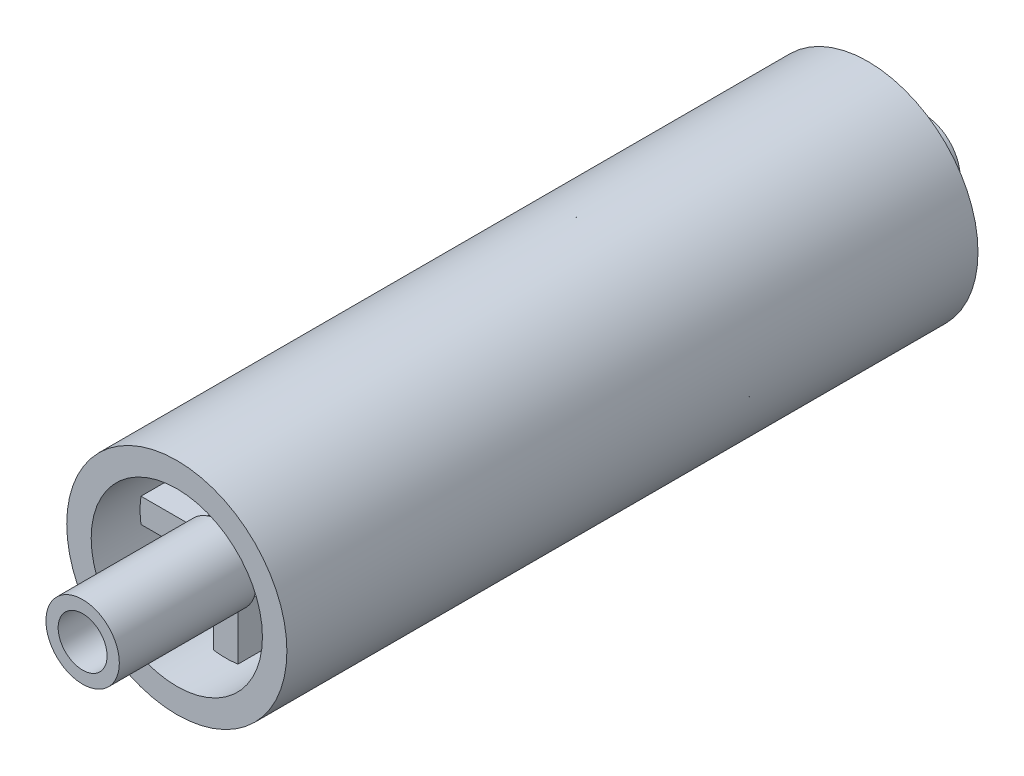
ISO-10303-21;
HEADER;
FILE_DESCRIPTION(('STEP AP214'),'2;1');
FILE_NAME('part.step','',(''),(''),'','','');
FILE_SCHEMA(('AUTOMOTIVE_DESIGN { 1 0 10303 214 1 1 1 1 }'));
ENDSEC;
DATA;
#1=APPLICATION_CONTEXT('core data for automotive mechanical design processes');
#2=APPLICATION_PROTOCOL_DEFINITION('international standard','automotive_design',2000,#1);
#3=PRODUCT_CONTEXT('',#1,'mechanical');
#4=PRODUCT('Part','Part','',(#3));
#5=PRODUCT_RELATED_PRODUCT_CATEGORY('part','',(#4));
#6=PRODUCT_DEFINITION_FORMATION('','',#4);
#7=PRODUCT_DEFINITION_CONTEXT('part definition',#1,'design');
#8=PRODUCT_DEFINITION('design','',#6,#7);
#9=PRODUCT_DEFINITION_SHAPE('','',#8);
#10=(LENGTH_UNIT() NAMED_UNIT(*) SI_UNIT(.MILLI.,.METRE.));
#11=(NAMED_UNIT(*) PLANE_ANGLE_UNIT() SI_UNIT($,.RADIAN.));
#12=(NAMED_UNIT(*) SI_UNIT($,.STERADIAN.) SOLID_ANGLE_UNIT());
#13=UNCERTAINTY_MEASURE_WITH_UNIT(LENGTH_MEASURE(1.E-05),#10,'distance_accuracy_value','');
#14=(GEOMETRIC_REPRESENTATION_CONTEXT(3) GLOBAL_UNCERTAINTY_ASSIGNED_CONTEXT((#13)) GLOBAL_UNIT_ASSIGNED_CONTEXT((#10,
#11,#12)) REPRESENTATION_CONTEXT('',''));
#15=CARTESIAN_POINT('',(0.,0.,0.));
#16=DIRECTION('',(0.,0.,1.));
#17=DIRECTION('',(1.,0.,0.));
#18=AXIS2_PLACEMENT_3D('',#15,#16,#17);
#19=CARTESIAN_POINT('',(0.,0.,-25.7));
#20=DIRECTION('',(0.,0.,-1.));
#21=DIRECTION('',(-1.,0.,0.));
#22=AXIS2_PLACEMENT_3D('',#19,#20,#21);
#23=CYLINDRICAL_SURFACE('',#22,3.);
#24=CARTESIAN_POINT('',(0.,0.,-25.7));
#25=DIRECTION('',(0.,0.,-1.));
#26=DIRECTION('',(-1.,0.,0.));
#27=AXIS2_PLACEMENT_3D('',#24,#25,#26);
#28=CIRCLE('',#27,3.);
#29=CARTESIAN_POINT('',(-3.,0.,-25.7));
#30=VERTEX_POINT('',#29);
#31=EDGE_CURVE('E51',#30,#30,#28,.T.);
#32=ORIENTED_EDGE('',*,*,#31,.T.);
#33=EDGE_LOOP('',(#32));
#34=FACE_BOUND('',#33,.T.);
#35=CARTESIAN_POINT('',(0.,0.,-32.8));
#36=DIRECTION('',(0.,0.,-1.));
#37=DIRECTION('',(-1.,0.,0.));
#38=AXIS2_PLACEMENT_3D('',#35,#36,#37);
#39=CIRCLE('',#38,3.);
#40=CARTESIAN_POINT('',(-3.,0.,-32.8));
#41=VERTEX_POINT('',#40);
#42=EDGE_CURVE('E120',#41,#41,#39,.T.);
#43=ORIENTED_EDGE('',*,*,#42,.F.);
#44=EDGE_LOOP('',(#43));
#45=FACE_BOUND('',#44,.T.);
#46=ADVANCED_FACE('F44',(#34,#45),#23,.T.);
#47=CARTESIAN_POINT('',(0.,0.,-25.7));
#48=DIRECTION('',(0.,0.,-1.));
#49=DIRECTION('',(-1.,0.,0.));
#50=AXIS2_PLACEMENT_3D('',#47,#48,#49);
#51=CYLINDRICAL_SURFACE('',#50,2.);
#52=CARTESIAN_POINT('',(0.,0.,-32.8));
#53=DIRECTION('',(0.,0.,-1.));
#54=DIRECTION('',(-1.,0.,0.));
#55=AXIS2_PLACEMENT_3D('',#52,#53,#54);
#56=CIRCLE('',#55,2.);
#57=CARTESIAN_POINT('',(1.3228756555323,-1.5,-32.8));
#58=VERTEX_POINT('',#57);
#59=CARTESIAN_POINT('',(1.3228756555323,1.5,-32.8));
#60=VERTEX_POINT('',#59);
#61=EDGE_CURVE('E83',#58,#60,#56,.F.);
#62=ORIENTED_EDGE('',*,*,#61,.F.);
#63=DIRECTION('',(0.,0.,-1.));
#64=VECTOR('',#63,1.);
#65=CARTESIAN_POINT('',(1.3228756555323,-1.5,-25.7));
#66=LINE('',#65,#64);
#67=CARTESIAN_POINT('',(1.3228756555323,-1.5,-25.7));
#68=VERTEX_POINT('',#67);
#69=EDGE_CURVE('E91',#68,#58,#66,.T.);
#70=ORIENTED_EDGE('',*,*,#69,.F.);
#71=CARTESIAN_POINT('',(0.,0.,-25.7));
#72=DIRECTION('',(0.,0.,-1.));
#73=DIRECTION('',(-1.,0.,0.));
#74=AXIS2_PLACEMENT_3D('',#71,#72,#73);
#75=CIRCLE('',#74,2.);
#76=CARTESIAN_POINT('',(1.3228756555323,1.5,-25.7));
#77=VERTEX_POINT('',#76);
#78=EDGE_CURVE('E94',#77,#68,#75,.T.);
#79=ORIENTED_EDGE('',*,*,#78,.F.);
#80=DIRECTION('',(0.,0.,-1.));
#81=VECTOR('',#80,1.);
#82=CARTESIAN_POINT('',(1.3228756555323,1.5,-25.7));
#83=LINE('',#82,#81);
#84=EDGE_CURVE('E93',#77,#60,#83,.T.);
#85=ORIENTED_EDGE('',*,*,#84,.T.);
#86=EDGE_LOOP('',(#62,#70,#79,#85));
#87=FACE_BOUND('',#86,.T.);
#88=ADVANCED_FACE('F89',(#87),#51,.F.);
#89=CARTESIAN_POINT('',(1.3228756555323,1.5,-25.7));
#90=DIRECTION('',(0.,1.,0.));
#91=DIRECTION('',(0.,0.,1.));
#92=AXIS2_PLACEMENT_3D('',#89,#90,#91);
#93=PLANE('',#92);
#94=DIRECTION('',(-1.,0.,0.));
#95=VECTOR('',#94,1.);
#96=CARTESIAN_POINT('',(1.3228756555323,1.5,-32.8));
#97=LINE('',#96,#95);
#98=CARTESIAN_POINT('',(-1.32287565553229,1.5,-32.8));
#99=VERTEX_POINT('',#98);
#100=EDGE_CURVE('E95',#60,#99,#97,.T.);
#101=ORIENTED_EDGE('',*,*,#100,.F.);
#102=ORIENTED_EDGE('',*,*,#84,.F.);
#103=DIRECTION('',(1.,0.,0.));
#104=VECTOR('',#103,1.);
#105=CARTESIAN_POINT('',(1.3228756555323,1.5,-25.7));
#106=LINE('',#105,#104);
#107=CARTESIAN_POINT('',(-1.32287565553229,1.5,-25.7));
#108=VERTEX_POINT('',#107);
#109=EDGE_CURVE('E102',#108,#77,#106,.T.);
#110=ORIENTED_EDGE('',*,*,#109,.F.);
#111=DIRECTION('',(0.,0.,-1.));
#112=VECTOR('',#111,1.);
#113=CARTESIAN_POINT('',(-1.32287565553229,1.5,-25.7));
#114=LINE('',#113,#112);
#115=EDGE_CURVE('E104',#108,#99,#114,.T.);
#116=ORIENTED_EDGE('',*,*,#115,.T.);
#117=EDGE_LOOP('',(#101,#102,#110,#116));
#118=FACE_BOUND('',#117,.T.);
#119=ADVANCED_FACE('F129',(#118),#93,.F.);
#120=CARTESIAN_POINT('',(0.,0.,-25.7));
#121=DIRECTION('',(0.,0.,-1.));
#122=DIRECTION('',(-1.,0.,0.));
#123=AXIS2_PLACEMENT_3D('',#120,#121,#122);
#124=CYLINDRICAL_SURFACE('',#123,2.);
#125=CARTESIAN_POINT('',(0.,0.,-32.8));
#126=DIRECTION('',(0.,0.,-1.));
#127=DIRECTION('',(-1.,0.,0.));
#128=AXIS2_PLACEMENT_3D('',#125,#126,#127);
#129=CIRCLE('',#128,2.);
#130=CARTESIAN_POINT('',(-1.3228756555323,-1.5,-32.8));
#131=VERTEX_POINT('',#130);
#132=EDGE_CURVE('E57',#99,#131,#129,.F.);
#133=ORIENTED_EDGE('',*,*,#132,.F.);
#134=ORIENTED_EDGE('',*,*,#115,.F.);
#135=CARTESIAN_POINT('',(0.,0.,-25.7));
#136=DIRECTION('',(0.,0.,-1.));
#137=DIRECTION('',(-1.,0.,0.));
#138=AXIS2_PLACEMENT_3D('',#135,#136,#137);
#139=CIRCLE('',#138,2.);
#140=CARTESIAN_POINT('',(-1.3228756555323,-1.5,-25.7));
#141=VERTEX_POINT('',#140);
#142=EDGE_CURVE('E65',#141,#108,#139,.T.);
#143=ORIENTED_EDGE('',*,*,#142,.F.);
#144=DIRECTION('',(0.,0.,-1.));
#145=VECTOR('',#144,1.);
#146=CARTESIAN_POINT('',(-1.3228756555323,-1.5,-25.7));
#147=LINE('',#146,#145);
#148=EDGE_CURVE('E101',#141,#131,#147,.T.);
#149=ORIENTED_EDGE('',*,*,#148,.T.);
#150=EDGE_LOOP('',(#133,#134,#143,#149));
#151=FACE_BOUND('',#150,.T.);
#152=ADVANCED_FACE('F134',(#151),#124,.F.);
#153=CARTESIAN_POINT('',(1.3228756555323,-1.5,-25.7));
#154=DIRECTION('',(0.,-1.,0.));
#155=DIRECTION('',(0.,0.,-1.));
#156=AXIS2_PLACEMENT_3D('',#153,#154,#155);
#157=PLANE('',#156);
#158=DIRECTION('',(1.,0.,0.));
#159=VECTOR('',#158,1.);
#160=CARTESIAN_POINT('',(1.3228756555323,-1.5,-32.8));
#161=LINE('',#160,#159);
#162=EDGE_CURVE('E13',#131,#58,#161,.T.);
#163=ORIENTED_EDGE('',*,*,#162,.F.);
#164=ORIENTED_EDGE('',*,*,#148,.F.);
#165=DIRECTION('',(-1.,0.,0.));
#166=VECTOR('',#165,1.);
#167=CARTESIAN_POINT('',(1.3228756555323,-1.5,-25.7));
#168=LINE('',#167,#166);
#169=EDGE_CURVE('E99',#68,#141,#168,.T.);
#170=ORIENTED_EDGE('',*,*,#169,.F.);
#171=ORIENTED_EDGE('',*,*,#69,.T.);
#172=EDGE_LOOP('',(#163,#164,#170,#171));
#173=FACE_BOUND('',#172,.T.);
#174=ADVANCED_FACE('F97',(#173),#157,.F.);
#175=CARTESIAN_POINT('',(0.,0.,-25.7));
#176=DIRECTION('',(0.,0.,-1.));
#177=DIRECTION('',(-1.,0.,0.));
#178=AXIS2_PLACEMENT_3D('',#175,#176,#177);
#179=PLANE('',#178);
#180=ORIENTED_EDGE('',*,*,#109,.T.);
#181=ORIENTED_EDGE('',*,*,#78,.T.);
#182=ORIENTED_EDGE('',*,*,#169,.T.);
#183=ORIENTED_EDGE('',*,*,#142,.T.);
#184=EDGE_LOOP('',(#180,#181,#182,#183));
#185=FACE_BOUND('',#184,.T.);
#186=ORIENTED_EDGE('',*,*,#31,.F.);
#187=EDGE_LOOP('',(#186));
#188=FACE_BOUND('',#187,.T.);
#189=ADVANCED_FACE('F139',(#185,#188),#179,.F.);
#190=CARTESIAN_POINT('',(0.,0.,-32.8));
#191=DIRECTION('',(0.,0.,-1.));
#192=DIRECTION('',(-1.,0.,0.));
#193=AXIS2_PLACEMENT_3D('',#190,#191,#192);
#194=PLANE('',#193);
#195=ORIENTED_EDGE('',*,*,#42,.T.);
#196=EDGE_LOOP('',(#195));
#197=FACE_BOUND('',#196,.T.);
#198=ORIENTED_EDGE('',*,*,#61,.T.);
#199=ORIENTED_EDGE('',*,*,#100,.T.);
#200=ORIENTED_EDGE('',*,*,#132,.T.);
#201=ORIENTED_EDGE('',*,*,#162,.T.);
#202=EDGE_LOOP('',(#198,#199,#200,#201));
#203=FACE_BOUND('',#202,.T.);
#204=ADVANCED_FACE('F82',(#197,#203),#194,.T.);
#205=CLOSED_SHELL('',(#46,#88,#119,#152,#174,#189,#204));
#206=MANIFOLD_SOLID_BREP('B2',#205);
#207=CARTESIAN_POINT('',(0.,0.,24.75));
#208=DIRECTION('',(0.,0.,1.));
#209=DIRECTION('',(1.,0.,0.));
#210=AXIS2_PLACEMENT_3D('',#207,#208,#209);
#211=CYLINDRICAL_SURFACE('',#210,3.);
#212=CARTESIAN_POINT('',(0.,0.,24.75));
#213=DIRECTION('',(0.,0.,1.));
#214=DIRECTION('',(1.,0.,0.));
#215=AXIS2_PLACEMENT_3D('',#212,#213,#214);
#216=CIRCLE('',#215,3.);
#217=CARTESIAN_POINT('',(3.,0.,24.75));
#218=VERTEX_POINT('',#217);
#219=EDGE_CURVE('E43',#218,#218,#216,.T.);
#220=ORIENTED_EDGE('',*,*,#219,.T.);
#221=EDGE_LOOP('',(#220));
#222=FACE_BOUND('',#221,.T.);
#223=CARTESIAN_POINT('',(0.,0.,35.95));
#224=DIRECTION('',(0.,0.,1.));
#225=DIRECTION('',(1.,0.,0.));
#226=AXIS2_PLACEMENT_3D('',#223,#224,#225);
#227=CIRCLE('',#226,3.);
#228=CARTESIAN_POINT('',(3.,0.,35.95));
#229=VERTEX_POINT('',#228);
#230=EDGE_CURVE('E208',#229,#229,#227,.T.);
#231=ORIENTED_EDGE('',*,*,#230,.F.);
#232=EDGE_LOOP('',(#231));
#233=FACE_BOUND('',#232,.T.);
#234=ADVANCED_FACE('F198',(#222,#233),#211,.T.);
#235=CARTESIAN_POINT('',(0.,0.,24.75));
#236=DIRECTION('',(0.,0.,1.));
#237=DIRECTION('',(1.,0.,0.));
#238=AXIS2_PLACEMENT_3D('',#235,#236,#237);
#239=PLANE('',#238);
#240=CARTESIAN_POINT('',(0.,0.,24.75));
#241=DIRECTION('',(0.,0.,1.));
#242=DIRECTION('',(1.,0.,0.));
#243=AXIS2_PLACEMENT_3D('',#240,#241,#242);
#244=CIRCLE('',#243,2.);
#245=CARTESIAN_POINT('',(2.,0.,24.75));
#246=VERTEX_POINT('',#245);
#247=EDGE_CURVE('E204',#246,#246,#244,.T.);
#248=ORIENTED_EDGE('',*,*,#247,.T.);
#249=EDGE_LOOP('',(#248));
#250=FACE_BOUND('',#249,.T.);
#251=ORIENTED_EDGE('',*,*,#219,.F.);
#252=EDGE_LOOP('',(#251));
#253=FACE_BOUND('',#252,.T.);
#254=ADVANCED_FACE('F227',(#250,#253),#239,.F.);
#255=CARTESIAN_POINT('',(0.,0.,24.75));
#256=DIRECTION('',(0.,0.,1.));
#257=DIRECTION('',(1.,0.,0.));
#258=AXIS2_PLACEMENT_3D('',#255,#256,#257);
#259=CYLINDRICAL_SURFACE('',#258,2.);
#260=ORIENTED_EDGE('',*,*,#247,.F.);
#261=EDGE_LOOP('',(#260));
#262=FACE_BOUND('',#261,.T.);
#263=CARTESIAN_POINT('',(0.,0.,35.95));
#264=DIRECTION('',(0.,0.,1.));
#265=DIRECTION('',(1.,0.,0.));
#266=AXIS2_PLACEMENT_3D('',#263,#264,#265);
#267=CIRCLE('',#266,2.);
#268=CARTESIAN_POINT('',(2.,0.,35.95));
#269=VERTEX_POINT('',#268);
#270=EDGE_CURVE('E212',#269,#269,#267,.T.);
#271=ORIENTED_EDGE('',*,*,#270,.T.);
#272=EDGE_LOOP('',(#271));
#273=FACE_BOUND('',#272,.T.);
#274=ADVANCED_FACE('F218',(#262,#273),#259,.F.);
#275=CARTESIAN_POINT('',(0.,0.,35.95));
#276=DIRECTION('',(0.,0.,1.));
#277=DIRECTION('',(1.,0.,0.));
#278=AXIS2_PLACEMENT_3D('',#275,#276,#277);
#279=PLANE('',#278);
#280=ORIENTED_EDGE('',*,*,#230,.T.);
#281=EDGE_LOOP('',(#280));
#282=FACE_BOUND('',#281,.T.);
#283=ORIENTED_EDGE('',*,*,#270,.F.);
#284=EDGE_LOOP('',(#283));
#285=FACE_BOUND('',#284,.T.);
#286=ADVANCED_FACE('F220',(#282,#285),#279,.T.);
#287=CLOSED_SHELL('',(#234,#254,#274,#286));
#288=MANIFOLD_SOLID_BREP('B7',#287);
#289=CARTESIAN_POINT('',(0.,0.,34.25));
#290=DIRECTION('',(0.,0.,-1.));
#291=DIRECTION('',(-1.,0.,0.));
#292=AXIS2_PLACEMENT_3D('',#289,#290,#291);
#293=CYLINDRICAL_SURFACE('',#292,9.);
#294=CARTESIAN_POINT('',(0.,0.,-28.25));
#295=DIRECTION('',(0.,0.,-1.));
#296=DIRECTION('',(-1.,0.,0.));
#297=AXIS2_PLACEMENT_3D('',#294,#295,#296);
#298=CIRCLE('',#297,9.);
#299=CARTESIAN_POINT('',(-9.,0.,-28.25));
#300=VERTEX_POINT('',#299);
#301=EDGE_CURVE('E446',#300,#300,#298,.T.);
#302=ORIENTED_EDGE('',*,*,#301,.F.);
#303=EDGE_LOOP('',(#302));
#304=FACE_BOUND('',#303,.T.);
#305=CARTESIAN_POINT('',(0.,0.,28.25));
#306=DIRECTION('',(0.,0.,1.));
#307=DIRECTION('',(1.,0.,0.));
#308=AXIS2_PLACEMENT_3D('',#305,#306,#307);
#309=CIRCLE('',#308,9.);
#310=CARTESIAN_POINT('',(9.,0.,28.25));
#311=VERTEX_POINT('',#310);
#312=EDGE_CURVE('E447',#311,#311,#309,.T.);
#313=ORIENTED_EDGE('',*,*,#312,.F.);
#314=EDGE_LOOP('',(#313));
#315=FACE_BOUND('',#314,.T.);
#316=ADVANCED_FACE('F266',(#304,#315),#293,.T.);
#317=CARTESIAN_POINT('',(0.,0.,34.25));
#318=DIRECTION('',(0.,0.,-1.));
#319=DIRECTION('',(-1.,0.,0.));
#320=AXIS2_PLACEMENT_3D('',#317,#318,#319);
#321=CYLINDRICAL_SURFACE('',#320,7.);
#322=CARTESIAN_POINT('',(0.,0.,-28.25));
#323=DIRECTION('',(0.,0.,-1.));
#324=DIRECTION('',(-1.,0.,0.));
#325=AXIS2_PLACEMENT_3D('',#322,#323,#324);
#326=CIRCLE('',#325,7.);
#327=CARTESIAN_POINT('',(-7.,0.,-28.25));
#328=VERTEX_POINT('',#327);
#329=EDGE_CURVE('E444',#328,#328,#326,.T.);
#330=ORIENTED_EDGE('',*,*,#329,.T.);
#331=EDGE_LOOP('',(#330));
#332=FACE_BOUND('',#331,.T.);
#333=CARTESIAN_POINT('',(0.,0.,24.25));
#334=DIRECTION('',(0.,0.,1.));
#335=DIRECTION('',(1.,0.,0.));
#336=AXIS2_PLACEMENT_3D('',#333,#334,#335);
#337=CIRCLE('',#336,7.);
#338=CARTESIAN_POINT('',(0.999999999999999,6.92820323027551,24.25));
#339=VERTEX_POINT('',#338);
#340=CARTESIAN_POINT('',(-1.,6.92820323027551,24.25));
#341=VERTEX_POINT('',#340);
#342=EDGE_CURVE('E389',#339,#341,#337,.T.);
#343=ORIENTED_EDGE('',*,*,#342,.F.);
#344=DIRECTION('',(0.,0.,-1.));
#345=VECTOR('',#344,1.);
#346=CARTESIAN_POINT('',(0.999999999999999,6.92820323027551,34.25));
#347=LINE('',#346,#345);
#348=CARTESIAN_POINT('',(0.999999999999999,6.92820323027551,-24.25));
#349=VERTEX_POINT('',#348);
#350=EDGE_CURVE('E442',#339,#349,#347,.T.);
#351=ORIENTED_EDGE('',*,*,#350,.T.);
#352=CARTESIAN_POINT('',(0.,0.,-24.25));
#353=DIRECTION('',(0.,0.,1.));
#354=DIRECTION('',(1.,0.,0.));
#355=AXIS2_PLACEMENT_3D('',#352,#353,#354);
#356=CIRCLE('',#355,7.);
#357=CARTESIAN_POINT('',(-1.,6.92820323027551,-24.25));
#358=VERTEX_POINT('',#357);
#359=EDGE_CURVE('E416',#349,#358,#356,.T.);
#360=ORIENTED_EDGE('',*,*,#359,.T.);
#361=DIRECTION('',(0.,0.,-1.));
#362=VECTOR('',#361,1.);
#363=CARTESIAN_POINT('',(-1.,6.92820323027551,34.25));
#364=LINE('',#363,#362);
#365=EDGE_CURVE('E439',#358,#341,#364,.F.);
#366=ORIENTED_EDGE('',*,*,#365,.T.);
#367=EDGE_LOOP('',(#343,#351,#360,#366));
#368=FACE_BOUND('',#367,.T.);
#369=CARTESIAN_POINT('',(-6.92820323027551,1.,24.25));
#370=VERTEX_POINT('',#369);
#371=CARTESIAN_POINT('',(-6.92820323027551,-1.,24.25));
#372=VERTEX_POINT('',#371);
#373=EDGE_CURVE('E438',#370,#372,#337,.T.);
#374=ORIENTED_EDGE('',*,*,#373,.F.);
#375=DIRECTION('',(0.,0.,-1.));
#376=VECTOR('',#375,1.);
#377=CARTESIAN_POINT('',(-6.92820323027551,1.,34.25));
#378=LINE('',#377,#376);
#379=CARTESIAN_POINT('',(-6.92820323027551,1.,-24.25));
#380=VERTEX_POINT('',#379);
#381=EDGE_CURVE('E434',#370,#380,#378,.T.);
#382=ORIENTED_EDGE('',*,*,#381,.T.);
#383=CARTESIAN_POINT('',(-6.92820323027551,-1.,-24.25));
#384=VERTEX_POINT('',#383);
#385=EDGE_CURVE('E435',#380,#384,#356,.T.);
#386=ORIENTED_EDGE('',*,*,#385,.T.);
#387=DIRECTION('',(0.,0.,-1.));
#388=VECTOR('',#387,1.);
#389=CARTESIAN_POINT('',(-6.92820323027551,-1.,34.25));
#390=LINE('',#389,#388);
#391=EDGE_CURVE('E431',#384,#372,#390,.F.);
#392=ORIENTED_EDGE('',*,*,#391,.T.);
#393=EDGE_LOOP('',(#374,#382,#386,#392));
#394=FACE_BOUND('',#393,.T.);
#395=CARTESIAN_POINT('',(-0.999999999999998,-6.92820323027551,24.25));
#396=VERTEX_POINT('',#395);
#397=CARTESIAN_POINT('',(1.,-6.92820323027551,24.25));
#398=VERTEX_POINT('',#397);
#399=EDGE_CURVE('E424',#396,#398,#337,.T.);
#400=ORIENTED_EDGE('',*,*,#399,.F.);
#401=DIRECTION('',(0.,0.,-1.));
#402=VECTOR('',#401,1.);
#403=CARTESIAN_POINT('',(-0.999999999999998,-6.92820323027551,34.25));
#404=LINE('',#403,#402);
#405=CARTESIAN_POINT('',(-0.999999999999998,-6.92820323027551,-24.25));
#406=VERTEX_POINT('',#405);
#407=EDGE_CURVE('E428',#396,#406,#404,.T.);
#408=ORIENTED_EDGE('',*,*,#407,.T.);
#409=CARTESIAN_POINT('',(1.,-6.92820323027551,-24.25));
#410=VERTEX_POINT('',#409);
#411=EDGE_CURVE('E417',#406,#410,#356,.T.);
#412=ORIENTED_EDGE('',*,*,#411,.T.);
#413=DIRECTION('',(0.,0.,-1.));
#414=VECTOR('',#413,1.);
#415=CARTESIAN_POINT('',(1.,-6.92820323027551,34.25));
#416=LINE('',#415,#414);
#417=EDGE_CURVE('E425',#410,#398,#416,.F.);
#418=ORIENTED_EDGE('',*,*,#417,.T.);
#419=EDGE_LOOP('',(#400,#408,#412,#418));
#420=FACE_BOUND('',#419,.T.);
#421=CARTESIAN_POINT('',(6.92820323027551,-1.,24.25));
#422=VERTEX_POINT('',#421);
#423=CARTESIAN_POINT('',(6.92820323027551,1.,24.25));
#424=VERTEX_POINT('',#423);
#425=EDGE_CURVE('E422',#422,#424,#337,.T.);
#426=ORIENTED_EDGE('',*,*,#425,.F.);
#427=DIRECTION('',(0.,0.,-1.));
#428=VECTOR('',#427,1.);
#429=CARTESIAN_POINT('',(6.92820323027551,-1.,34.25));
#430=LINE('',#429,#428);
#431=CARTESIAN_POINT('',(6.92820323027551,-1.,-24.25));
#432=VERTEX_POINT('',#431);
#433=EDGE_CURVE('E420',#422,#432,#430,.T.);
#434=ORIENTED_EDGE('',*,*,#433,.T.);
#435=CARTESIAN_POINT('',(6.92820323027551,1.,-24.25));
#436=VERTEX_POINT('',#435);
#437=EDGE_CURVE('E401',#432,#436,#356,.T.);
#438=ORIENTED_EDGE('',*,*,#437,.T.);
#439=DIRECTION('',(0.,0.,-1.));
#440=VECTOR('',#439,1.);
#441=CARTESIAN_POINT('',(6.92820323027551,1.,34.25));
#442=LINE('',#441,#440);
#443=EDGE_CURVE('E414',#436,#424,#442,.F.);
#444=ORIENTED_EDGE('',*,*,#443,.T.);
#445=EDGE_LOOP('',(#426,#434,#438,#444));
#446=FACE_BOUND('',#445,.T.);
#447=CARTESIAN_POINT('',(0.,0.,28.25));
#448=DIRECTION('',(0.,0.,1.));
#449=DIRECTION('',(1.,0.,0.));
#450=AXIS2_PLACEMENT_3D('',#447,#448,#449);
#451=CIRCLE('',#450,7.);
#452=CARTESIAN_POINT('',(7.,0.,28.25));
#453=VERTEX_POINT('',#452);
#454=EDGE_CURVE('E269',#453,#453,#451,.T.);
#455=ORIENTED_EDGE('',*,*,#454,.T.);
#456=EDGE_LOOP('',(#455));
#457=FACE_BOUND('',#456,.T.);
#458=ADVANCED_FACE('F516',(#332,#368,#394,#420,#446,#457),#321,.F.);
#459=CARTESIAN_POINT('',(0.999999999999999,7.53819055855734,24.25));
#460=DIRECTION('',(0.,0.,1.));
#461=DIRECTION('',(1.,0.,0.));
#462=AXIS2_PLACEMENT_3D('',#459,#460,#461);
#463=PLANE('',#462);
#464=CARTESIAN_POINT('',(0.,0.,24.25));
#465=DIRECTION('',(0.,0.,1.));
#466=DIRECTION('',(1.,0.,0.));
#467=AXIS2_PLACEMENT_3D('',#464,#465,#466);
#468=CIRCLE('',#467,3.);
#469=CARTESIAN_POINT('',(1.,2.82842712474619,24.25));
#470=VERTEX_POINT('',#469);
#471=CARTESIAN_POINT('',(-1.,2.82842712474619,24.25));
#472=VERTEX_POINT('',#471);
#473=EDGE_CURVE('E461',#470,#472,#468,.T.);
#474=ORIENTED_EDGE('',*,*,#473,.F.);
#475=DIRECTION('',(0.,1.,0.));
#476=VECTOR('',#475,1.);
#477=CARTESIAN_POINT('',(0.999999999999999,7.53819055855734,24.25));
#478=LINE('',#477,#476);
#479=EDGE_CURVE('E406',#470,#339,#478,.T.);
#480=ORIENTED_EDGE('',*,*,#479,.T.);
#481=ORIENTED_EDGE('',*,*,#342,.T.);
#482=DIRECTION('',(0.,-1.,0.));
#483=VECTOR('',#482,1.);
#484=CARTESIAN_POINT('',(-1.,7.53819055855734,24.25));
#485=LINE('',#484,#483);
#486=EDGE_CURVE('E478',#341,#472,#485,.T.);
#487=ORIENTED_EDGE('',*,*,#486,.T.);
#488=EDGE_LOOP('',(#474,#480,#481,#487));
#489=FACE_BOUND('',#488,.T.);
#490=ADVANCED_FACE('F529',(#489),#463,.T.);
#491=CARTESIAN_POINT('',(-2.82842712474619,1.,24.25));
#492=VERTEX_POINT('',#491);
#493=CARTESIAN_POINT('',(-2.82842712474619,-1.,24.25));
#494=VERTEX_POINT('',#493);
#495=EDGE_CURVE('E472',#492,#494,#468,.T.);
#496=ORIENTED_EDGE('',*,*,#495,.F.);
#497=DIRECTION('',(-1.,0.,0.));
#498=VECTOR('',#497,1.);
#499=CARTESIAN_POINT('',(-8.12390978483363,1.,24.25));
#500=LINE('',#499,#498);
#501=EDGE_CURVE('E481',#492,#370,#500,.T.);
#502=ORIENTED_EDGE('',*,*,#501,.T.);
#503=ORIENTED_EDGE('',*,*,#373,.T.);
#504=DIRECTION('',(1.,0.,0.));
#505=VECTOR('',#504,1.);
#506=CARTESIAN_POINT('',(-8.12390978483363,-1.,24.25));
#507=LINE('',#506,#505);
#508=EDGE_CURVE('E483',#372,#494,#507,.T.);
#509=ORIENTED_EDGE('',*,*,#508,.T.);
#510=EDGE_LOOP('',(#496,#502,#503,#509));
#511=FACE_BOUND('',#510,.T.);
#512=ADVANCED_FACE('F608',(#511),#463,.T.);
#513=CARTESIAN_POINT('',(-0.999999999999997,-2.82842712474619,24.25));
#514=VERTEX_POINT('',#513);
#515=CARTESIAN_POINT('',(1.,-2.82842712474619,24.25));
#516=VERTEX_POINT('',#515);
#517=EDGE_CURVE('E462',#514,#516,#468,.T.);
#518=ORIENTED_EDGE('',*,*,#517,.F.);
#519=DIRECTION('',(0.,-1.,0.));
#520=VECTOR('',#519,1.);
#521=CARTESIAN_POINT('',(-0.999999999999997,-1.,24.25));
#522=LINE('',#521,#520);
#523=EDGE_CURVE('E486',#514,#396,#522,.T.);
#524=ORIENTED_EDGE('',*,*,#523,.T.);
#525=ORIENTED_EDGE('',*,*,#399,.T.);
#526=DIRECTION('',(0.,1.,0.));
#527=VECTOR('',#526,1.);
#528=CARTESIAN_POINT('',(1.,-1.,24.25));
#529=LINE('',#528,#527);
#530=EDGE_CURVE('E488',#398,#516,#529,.T.);
#531=ORIENTED_EDGE('',*,*,#530,.T.);
#532=EDGE_LOOP('',(#518,#524,#525,#531));
#533=FACE_BOUND('',#532,.T.);
#534=ADVANCED_FACE('F582',(#533),#463,.T.);
#535=CARTESIAN_POINT('',(0.999999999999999,7.53819055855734,-24.25));
#536=DIRECTION('',(0.,0.,1.));
#537=DIRECTION('',(1.,0.,0.));
#538=AXIS2_PLACEMENT_3D('',#535,#536,#537);
#539=PLANE('',#538);
#540=DIRECTION('',(0.,1.,0.));
#541=VECTOR('',#540,1.);
#542=CARTESIAN_POINT('',(0.999999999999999,7.53819055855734,-24.25));
#543=LINE('',#542,#541);
#544=CARTESIAN_POINT('',(1.,2.82842712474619,-24.25));
#545=VERTEX_POINT('',#544);
#546=EDGE_CURVE('E494',#545,#349,#543,.T.);
#547=ORIENTED_EDGE('',*,*,#546,.F.);
#548=CARTESIAN_POINT('',(0.,0.,-24.25));
#549=DIRECTION('',(0.,0.,1.));
#550=DIRECTION('',(1.,0.,0.));
#551=AXIS2_PLACEMENT_3D('',#548,#549,#550);
#552=CIRCLE('',#551,3.);
#553=CARTESIAN_POINT('',(-1.,2.82842712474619,-24.25));
#554=VERTEX_POINT('',#553);
#555=EDGE_CURVE('E196',#545,#554,#552,.T.);
#556=ORIENTED_EDGE('',*,*,#555,.T.);
#557=DIRECTION('',(0.,-1.,0.));
#558=VECTOR('',#557,1.);
#559=CARTESIAN_POINT('',(-1.,7.53819055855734,-24.25));
#560=LINE('',#559,#558);
#561=EDGE_CURVE('E496',#358,#554,#560,.T.);
#562=ORIENTED_EDGE('',*,*,#561,.F.);
#563=ORIENTED_EDGE('',*,*,#359,.F.);
#564=EDGE_LOOP('',(#547,#556,#562,#563));
#565=FACE_BOUND('',#564,.T.);
#566=ADVANCED_FACE('F540',(#565),#539,.F.);
#567=DIRECTION('',(-1.,0.,0.));
#568=VECTOR('',#567,1.);
#569=CARTESIAN_POINT('',(-8.12390978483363,1.,-24.25));
#570=LINE('',#569,#568);
#571=CARTESIAN_POINT('',(-2.82842712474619,1.,-24.25));
#572=VERTEX_POINT('',#571);
#573=EDGE_CURVE('E499',#572,#380,#570,.T.);
#574=ORIENTED_EDGE('',*,*,#573,.F.);
#575=CARTESIAN_POINT('',(-2.82842712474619,-1.,-24.25));
#576=VERTEX_POINT('',#575);
#577=EDGE_CURVE('E274',#572,#576,#552,.T.);
#578=ORIENTED_EDGE('',*,*,#577,.T.);
#579=DIRECTION('',(1.,0.,0.));
#580=VECTOR('',#579,1.);
#581=CARTESIAN_POINT('',(-8.12390978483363,-1.,-24.25));
#582=LINE('',#581,#580);
#583=EDGE_CURVE('E501',#384,#576,#582,.T.);
#584=ORIENTED_EDGE('',*,*,#583,.F.);
#585=ORIENTED_EDGE('',*,*,#385,.F.);
#586=EDGE_LOOP('',(#574,#578,#584,#585));
#587=FACE_BOUND('',#586,.T.);
#588=ADVANCED_FACE('F552',(#587),#539,.F.);
#589=DIRECTION('',(0.,-1.,0.));
#590=VECTOR('',#589,1.);
#591=CARTESIAN_POINT('',(-0.999999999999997,-1.,-24.25));
#592=LINE('',#591,#590);
#593=CARTESIAN_POINT('',(-0.999999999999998,-2.82842712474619,-24.25));
#594=VERTEX_POINT('',#593);
#595=EDGE_CURVE('E409',#594,#406,#592,.T.);
#596=ORIENTED_EDGE('',*,*,#595,.F.);
#597=CARTESIAN_POINT('',(1.,-2.82842712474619,-24.25));
#598=VERTEX_POINT('',#597);
#599=EDGE_CURVE('E388',#594,#598,#552,.T.);
#600=ORIENTED_EDGE('',*,*,#599,.T.);
#601=DIRECTION('',(0.,1.,0.));
#602=VECTOR('',#601,1.);
#603=CARTESIAN_POINT('',(1.,-1.,-24.25));
#604=LINE('',#603,#602);
#605=EDGE_CURVE('E404',#410,#598,#604,.T.);
#606=ORIENTED_EDGE('',*,*,#605,.F.);
#607=ORIENTED_EDGE('',*,*,#411,.F.);
#608=EDGE_LOOP('',(#596,#600,#606,#607));
#609=FACE_BOUND('',#608,.T.);
#610=ADVANCED_FACE('F513',(#609),#539,.F.);
#611=CARTESIAN_POINT('',(0.999999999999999,7.53819055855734,24.25));
#612=DIRECTION('',(-1.,0.,0.));
#613=DIRECTION('',(0.,-1.,0.));
#614=AXIS2_PLACEMENT_3D('',#611,#612,#613);
#615=PLANE('',#614);
#616=ORIENTED_EDGE('',*,*,#479,.F.);
#617=DIRECTION('',(0.,0.,1.));
#618=VECTOR('',#617,1.);
#619=CARTESIAN_POINT('',(1.,2.82842712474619,-34.25));
#620=LINE('',#619,#618);
#621=EDGE_CURVE('E474',#470,#545,#620,.F.);
#622=ORIENTED_EDGE('',*,*,#621,.T.);
#623=ORIENTED_EDGE('',*,*,#546,.T.);
#624=ORIENTED_EDGE('',*,*,#350,.F.);
#625=EDGE_LOOP('',(#616,#622,#623,#624));
#626=FACE_BOUND('',#625,.T.);
#627=ADVANCED_FACE('F543',(#626),#615,.F.);
#628=CARTESIAN_POINT('',(-1.,7.53819055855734,24.25));
#629=DIRECTION('',(1.,0.,0.));
#630=DIRECTION('',(0.,1.,0.));
#631=AXIS2_PLACEMENT_3D('',#628,#629,#630);
#632=PLANE('',#631);
#633=ORIENTED_EDGE('',*,*,#561,.T.);
#634=DIRECTION('',(0.,0.,1.));
#635=VECTOR('',#634,1.);
#636=CARTESIAN_POINT('',(-1.,2.82842712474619,-34.25));
#637=LINE('',#636,#635);
#638=EDGE_CURVE('E283',#554,#472,#637,.T.);
#639=ORIENTED_EDGE('',*,*,#638,.T.);
#640=ORIENTED_EDGE('',*,*,#486,.F.);
#641=ORIENTED_EDGE('',*,*,#365,.F.);
#642=EDGE_LOOP('',(#633,#639,#640,#641));
#643=FACE_BOUND('',#642,.T.);
#644=ADVANCED_FACE('F535',(#643),#632,.F.);
#645=CARTESIAN_POINT('',(-8.12390978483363,1.,24.25));
#646=DIRECTION('',(0.,-1.,0.));
#647=DIRECTION('',(0.,0.,-1.));
#648=AXIS2_PLACEMENT_3D('',#645,#646,#647);
#649=PLANE('',#648);
#650=ORIENTED_EDGE('',*,*,#501,.F.);
#651=DIRECTION('',(0.,0.,1.));
#652=VECTOR('',#651,1.);
#653=CARTESIAN_POINT('',(-2.82842712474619,1.,-34.25));
#654=LINE('',#653,#652);
#655=EDGE_CURVE('E469',#492,#572,#654,.F.);
#656=ORIENTED_EDGE('',*,*,#655,.T.);
#657=ORIENTED_EDGE('',*,*,#573,.T.);
#658=ORIENTED_EDGE('',*,*,#381,.F.);
#659=EDGE_LOOP('',(#650,#656,#657,#658));
#660=FACE_BOUND('',#659,.T.);
#661=ADVANCED_FACE('F550',(#660),#649,.F.);
#662=CARTESIAN_POINT('',(-8.12390978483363,-1.,24.25));
#663=DIRECTION('',(0.,1.,0.));
#664=DIRECTION('',(-1.,0.,0.));
#665=AXIS2_PLACEMENT_3D('',#662,#663,#664);
#666=PLANE('',#665);
#667=ORIENTED_EDGE('',*,*,#583,.T.);
#668=DIRECTION('',(0.,0.,1.));
#669=VECTOR('',#668,1.);
#670=CARTESIAN_POINT('',(-2.82842712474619,-1.,-34.25));
#671=LINE('',#670,#669);
#672=EDGE_CURVE('E290',#576,#494,#671,.T.);
#673=ORIENTED_EDGE('',*,*,#672,.T.);
#674=ORIENTED_EDGE('',*,*,#508,.F.);
#675=ORIENTED_EDGE('',*,*,#391,.F.);
#676=EDGE_LOOP('',(#667,#673,#674,#675));
#677=FACE_BOUND('',#676,.T.);
#678=ADVANCED_FACE('F596',(#677),#666,.F.);
#679=CARTESIAN_POINT('',(-0.999999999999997,-1.,24.25));
#680=DIRECTION('',(1.,0.,0.));
#681=DIRECTION('',(0.,1.,0.));
#682=AXIS2_PLACEMENT_3D('',#679,#680,#681);
#683=PLANE('',#682);
#684=ORIENTED_EDGE('',*,*,#523,.F.);
#685=DIRECTION('',(0.,0.,1.));
#686=VECTOR('',#685,1.);
#687=CARTESIAN_POINT('',(-0.999999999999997,-2.82842712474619,-34.25));
#688=LINE('',#687,#686);
#689=EDGE_CURVE('E465',#514,#594,#688,.F.);
#690=ORIENTED_EDGE('',*,*,#689,.T.);
#691=ORIENTED_EDGE('',*,*,#595,.T.);
#692=ORIENTED_EDGE('',*,*,#407,.F.);
#693=EDGE_LOOP('',(#684,#690,#691,#692));
#694=FACE_BOUND('',#693,.T.);
#695=ADVANCED_FACE('F508',(#694),#683,.F.);
#696=CARTESIAN_POINT('',(1.,-1.,24.25));
#697=DIRECTION('',(-1.,0.,0.));
#698=DIRECTION('',(0.,-1.,0.));
#699=AXIS2_PLACEMENT_3D('',#696,#697,#698);
#700=PLANE('',#699);
#701=ORIENTED_EDGE('',*,*,#605,.T.);
#702=DIRECTION('',(0.,0.,1.));
#703=VECTOR('',#702,1.);
#704=CARTESIAN_POINT('',(1.,-2.82842712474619,-34.25));
#705=LINE('',#704,#703);
#706=EDGE_CURVE('E460',#598,#516,#705,.T.);
#707=ORIENTED_EDGE('',*,*,#706,.T.);
#708=ORIENTED_EDGE('',*,*,#530,.F.);
#709=ORIENTED_EDGE('',*,*,#417,.F.);
#710=EDGE_LOOP('',(#701,#707,#708,#709));
#711=FACE_BOUND('',#710,.T.);
#712=ADVANCED_FACE('F590',(#711),#700,.F.);
#713=CARTESIAN_POINT('',(1.,-1.,24.25));
#714=DIRECTION('',(0.,1.,0.));
#715=DIRECTION('',(0.,0.,1.));
#716=AXIS2_PLACEMENT_3D('',#713,#714,#715);
#717=PLANE('',#716);
#718=DIRECTION('',(1.,0.,0.));
#719=VECTOR('',#718,1.);
#720=CARTESIAN_POINT('',(1.,-1.,24.25));
#721=LINE('',#720,#719);
#722=CARTESIAN_POINT('',(2.82842712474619,-1.,24.25));
#723=VERTEX_POINT('',#722);
#724=EDGE_CURVE('E396',#723,#422,#721,.T.);
#725=ORIENTED_EDGE('',*,*,#724,.F.);
#726=DIRECTION('',(0.,0.,1.));
#727=VECTOR('',#726,1.);
#728=CARTESIAN_POINT('',(2.82842712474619,-1.,-34.25));
#729=LINE('',#728,#727);
#730=CARTESIAN_POINT('',(2.82842712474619,-1.,-24.25));
#731=VERTEX_POINT('',#730);
#732=EDGE_CURVE('E381',#723,#731,#729,.F.);
#733=ORIENTED_EDGE('',*,*,#732,.T.);
#734=DIRECTION('',(1.,0.,0.));
#735=VECTOR('',#734,1.);
#736=CARTESIAN_POINT('',(1.,-1.,-24.25));
#737=LINE('',#736,#735);
#738=EDGE_CURVE('E394',#731,#432,#737,.T.);
#739=ORIENTED_EDGE('',*,*,#738,.T.);
#740=ORIENTED_EDGE('',*,*,#433,.F.);
#741=EDGE_LOOP('',(#725,#733,#739,#740));
#742=FACE_BOUND('',#741,.T.);
#743=ADVANCED_FACE('F392',(#742),#717,.F.);
#744=CARTESIAN_POINT('',(1.,1.,24.25));
#745=DIRECTION('',(0.,-1.,0.));
#746=DIRECTION('',(1.,0.,0.));
#747=AXIS2_PLACEMENT_3D('',#744,#745,#746);
#748=PLANE('',#747);
#749=DIRECTION('',(-1.,0.,0.));
#750=VECTOR('',#749,1.);
#751=CARTESIAN_POINT('',(1.,1.,-24.25));
#752=LINE('',#751,#750);
#753=CARTESIAN_POINT('',(2.82842712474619,1.,-24.25));
#754=VERTEX_POINT('',#753);
#755=EDGE_CURVE('E403',#436,#754,#752,.T.);
#756=ORIENTED_EDGE('',*,*,#755,.T.);
#757=DIRECTION('',(0.,0.,1.));
#758=VECTOR('',#757,1.);
#759=CARTESIAN_POINT('',(2.82842712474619,1.,-34.25));
#760=LINE('',#759,#758);
#761=CARTESIAN_POINT('',(2.82842712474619,1.,24.25));
#762=VERTEX_POINT('',#761);
#763=EDGE_CURVE('E384',#754,#762,#760,.T.);
#764=ORIENTED_EDGE('',*,*,#763,.T.);
#765=DIRECTION('',(-1.,0.,0.));
#766=VECTOR('',#765,1.);
#767=CARTESIAN_POINT('',(1.,1.,24.25));
#768=LINE('',#767,#766);
#769=EDGE_CURVE('E415',#424,#762,#768,.T.);
#770=ORIENTED_EDGE('',*,*,#769,.F.);
#771=ORIENTED_EDGE('',*,*,#443,.F.);
#772=EDGE_LOOP('',(#756,#764,#770,#771));
#773=FACE_BOUND('',#772,.T.);
#774=ADVANCED_FACE('F580',(#773),#748,.F.);
#775=EDGE_CURVE('E397',#723,#762,#468,.T.);
#776=ORIENTED_EDGE('',*,*,#775,.F.);
#777=ORIENTED_EDGE('',*,*,#724,.T.);
#778=ORIENTED_EDGE('',*,*,#425,.T.);
#779=ORIENTED_EDGE('',*,*,#769,.T.);
#780=EDGE_LOOP('',(#776,#777,#778,#779));
#781=FACE_BOUND('',#780,.T.);
#782=ADVANCED_FACE('F578',(#781),#463,.T.);
#783=ORIENTED_EDGE('',*,*,#738,.F.);
#784=EDGE_CURVE('E276',#731,#754,#552,.T.);
#785=ORIENTED_EDGE('',*,*,#784,.T.);
#786=ORIENTED_EDGE('',*,*,#755,.F.);
#787=ORIENTED_EDGE('',*,*,#437,.F.);
#788=EDGE_LOOP('',(#783,#785,#786,#787));
#789=FACE_BOUND('',#788,.T.);
#790=ADVANCED_FACE('F399',(#789),#539,.F.);
#791=CARTESIAN_POINT('',(0.,0.,-34.25));
#792=DIRECTION('',(0.,0.,1.));
#793=DIRECTION('',(1.,0.,0.));
#794=AXIS2_PLACEMENT_3D('',#791,#792,#793);
#795=CYLINDRICAL_SURFACE('',#794,3.);
#796=ORIENTED_EDGE('',*,*,#775,.T.);
#797=ORIENTED_EDGE('',*,*,#763,.F.);
#798=ORIENTED_EDGE('',*,*,#784,.F.);
#799=ORIENTED_EDGE('',*,*,#732,.F.);
#800=EDGE_LOOP('',(#796,#797,#798,#799));
#801=FACE_BOUND('',#800,.T.);
#802=ADVANCED_FACE('F380',(#801),#795,.F.);
#803=ORIENTED_EDGE('',*,*,#517,.T.);
#804=ORIENTED_EDGE('',*,*,#706,.F.);
#805=ORIENTED_EDGE('',*,*,#599,.F.);
#806=ORIENTED_EDGE('',*,*,#689,.F.);
#807=EDGE_LOOP('',(#803,#804,#805,#806));
#808=FACE_BOUND('',#807,.T.);
#809=ADVANCED_FACE('F577',(#808),#795,.F.);
#810=ORIENTED_EDGE('',*,*,#495,.T.);
#811=ORIENTED_EDGE('',*,*,#672,.F.);
#812=ORIENTED_EDGE('',*,*,#577,.F.);
#813=ORIENTED_EDGE('',*,*,#655,.F.);
#814=EDGE_LOOP('',(#810,#811,#812,#813));
#815=FACE_BOUND('',#814,.T.);
#816=ADVANCED_FACE('F573',(#815),#795,.F.);
#817=ORIENTED_EDGE('',*,*,#473,.T.);
#818=ORIENTED_EDGE('',*,*,#638,.F.);
#819=ORIENTED_EDGE('',*,*,#555,.F.);
#820=ORIENTED_EDGE('',*,*,#621,.F.);
#821=EDGE_LOOP('',(#817,#818,#819,#820));
#822=FACE_BOUND('',#821,.T.);
#823=ADVANCED_FACE('F541',(#822),#795,.F.);
#824=CARTESIAN_POINT('',(0.,0.,-28.25));
#825=DIRECTION('',(0.,0.,-1.));
#826=DIRECTION('',(-1.,0.,0.));
#827=AXIS2_PLACEMENT_3D('',#824,#825,#826);
#828=PLANE('',#827);
#829=ORIENTED_EDGE('',*,*,#329,.F.);
#830=EDGE_LOOP('',(#829));
#831=FACE_BOUND('',#830,.T.);
#832=ORIENTED_EDGE('',*,*,#301,.T.);
#833=EDGE_LOOP('',(#832));
#834=FACE_BOUND('',#833,.T.);
#835=ADVANCED_FACE('F562',(#831,#834),#828,.T.);
#836=CARTESIAN_POINT('',(0.,0.,28.25));
#837=DIRECTION('',(0.,0.,1.));
#838=DIRECTION('',(1.,0.,0.));
#839=AXIS2_PLACEMENT_3D('',#836,#837,#838);
#840=PLANE('',#839);
#841=ORIENTED_EDGE('',*,*,#454,.F.);
#842=EDGE_LOOP('',(#841));
#843=FACE_BOUND('',#842,.T.);
#844=ORIENTED_EDGE('',*,*,#312,.T.);
#845=EDGE_LOOP('',(#844));
#846=FACE_BOUND('',#845,.T.);
#847=ADVANCED_FACE('F564',(#843,#846),#840,.T.);
#848=CLOSED_SHELL('',(#316,#458,#490,#512,#534,#566,#588,#610,#627,#644,#661,#678,#695,#712,
#743,#774,#782,#790,#802,#809,#816,#823,#835,#847));
#849=MANIFOLD_SOLID_BREP('B38',#848);
#850=ADVANCED_BREP_SHAPE_REPRESENTATION('',(#18,#206,#288,#849),#14);
#851=SHAPE_DEFINITION_REPRESENTATION(#9,#850);
ENDSEC;
END-ISO-10303-21;
